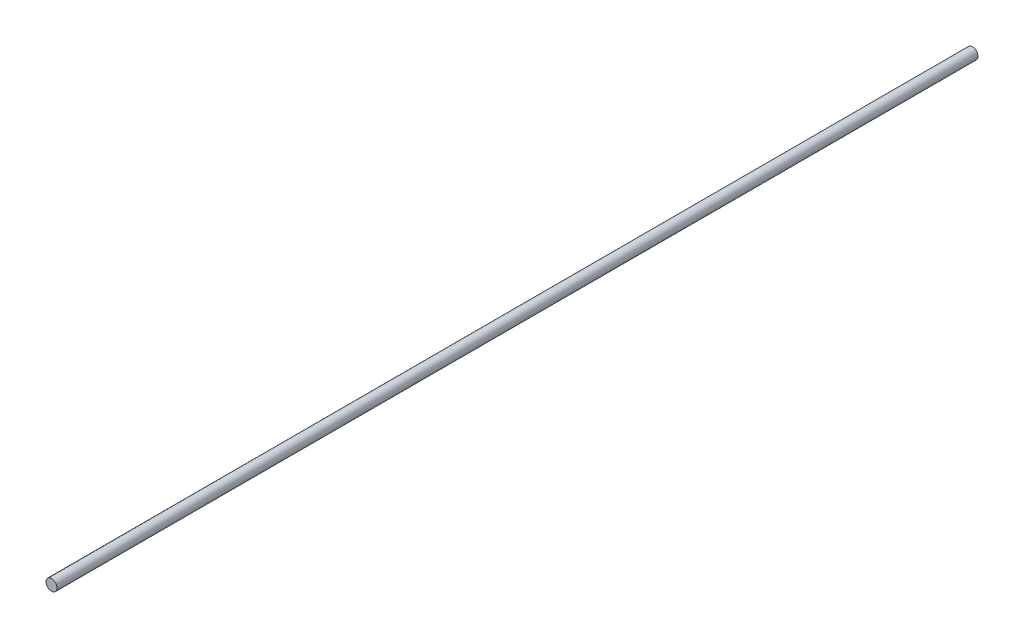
from build123d import *

# Parameters (mm, degrees)
SKETCH1_R           = 30
BOSS_EXTRUDE1_DEPTH = 5000


with BuildPart() as part:
    # Sketch1 → Boss-Extrude1 (new body)
    with BuildSketch(Plane.XY):
        Circle(SKETCH1_R)
    extrude(amount=-BOSS_EXTRUDE1_DEPTH)


solid = part.part
